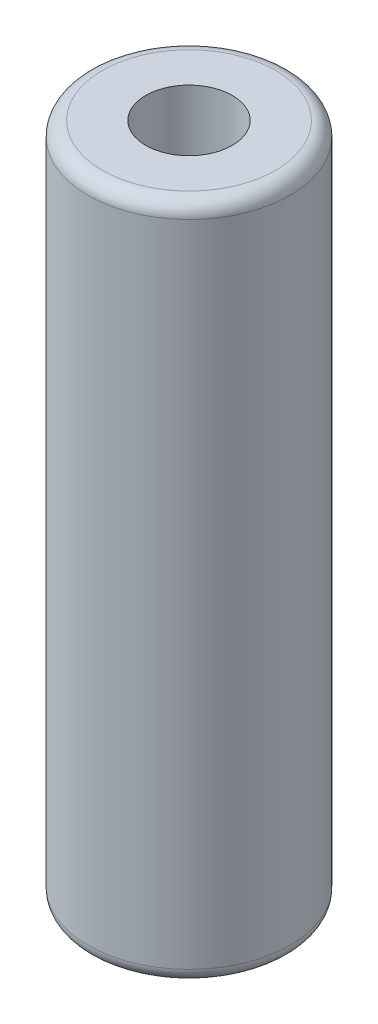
ISO-10303-21;
HEADER;
FILE_DESCRIPTION(('STEP AP214'),'2;1');
FILE_NAME('part.step','',(''),(''),'','','');
FILE_SCHEMA(('AUTOMOTIVE_DESIGN { 1 0 10303 214 1 1 1 1 }'));
ENDSEC;
DATA;
#1=APPLICATION_CONTEXT('core data for automotive mechanical design processes');
#2=APPLICATION_PROTOCOL_DEFINITION('international standard','automotive_design',2000,#1);
#3=PRODUCT_CONTEXT('',#1,'mechanical');
#4=PRODUCT('Part','Part','',(#3));
#5=PRODUCT_RELATED_PRODUCT_CATEGORY('part','',(#4));
#6=PRODUCT_DEFINITION_FORMATION('','',#4);
#7=PRODUCT_DEFINITION_CONTEXT('part definition',#1,'design');
#8=PRODUCT_DEFINITION('design','',#6,#7);
#9=PRODUCT_DEFINITION_SHAPE('','',#8);
#10=(LENGTH_UNIT() NAMED_UNIT(*) SI_UNIT(.MILLI.,.METRE.));
#11=(NAMED_UNIT(*) PLANE_ANGLE_UNIT() SI_UNIT($,.RADIAN.));
#12=(NAMED_UNIT(*) SI_UNIT($,.STERADIAN.) SOLID_ANGLE_UNIT());
#13=UNCERTAINTY_MEASURE_WITH_UNIT(LENGTH_MEASURE(1.E-05),#10,'distance_accuracy_value','');
#14=(GEOMETRIC_REPRESENTATION_CONTEXT(3) GLOBAL_UNCERTAINTY_ASSIGNED_CONTEXT((#13)) GLOBAL_UNIT_ASSIGNED_CONTEXT((#10,
#11,#12)) REPRESENTATION_CONTEXT('',''));
#15=CARTESIAN_POINT('',(0.,0.,0.));
#16=DIRECTION('',(0.,0.,1.));
#17=DIRECTION('',(1.,0.,0.));
#18=AXIS2_PLACEMENT_3D('',#15,#16,#17);
#19=CARTESIAN_POINT('',(0.,47.,0.));
#20=DIRECTION('',(0.,-1.,0.));
#21=DIRECTION('',(0.,0.,-1.));
#22=AXIS2_PLACEMENT_3D('',#19,#20,#21);
#23=CYLINDRICAL_SURFACE('',#22,7.);
#24=CARTESIAN_POINT('',(0.,1.,0.));
#25=DIRECTION('',(0.,1.,0.));
#26=DIRECTION('',(0.,0.,1.));
#27=AXIS2_PLACEMENT_3D('',#24,#25,#26);
#28=CIRCLE('',#27,7.);
#29=CARTESIAN_POINT('',(0.,1.,7.));
#30=VERTEX_POINT('',#29);
#31=EDGE_CURVE('E42',#30,#30,#28,.T.);
#32=ORIENTED_EDGE('',*,*,#31,.T.);
#33=EDGE_LOOP('',(#32));
#34=FACE_BOUND('',#33,.T.);
#35=CARTESIAN_POINT('',(0.,46.,0.));
#36=DIRECTION('',(0.,1.,0.));
#37=DIRECTION('',(0.,0.,1.));
#38=AXIS2_PLACEMENT_3D('',#35,#36,#37);
#39=CIRCLE('',#38,7.);
#40=CARTESIAN_POINT('',(0.,46.,7.));
#41=VERTEX_POINT('',#40);
#42=EDGE_CURVE('E46',#41,#41,#39,.F.);
#43=ORIENTED_EDGE('',*,*,#42,.T.);
#44=EDGE_LOOP('',(#43));
#45=FACE_BOUND('',#44,.T.);
#46=ADVANCED_FACE('F35',(#34,#45),#23,.T.);
#47=CARTESIAN_POINT('',(0.,47.,0.));
#48=DIRECTION('',(0.,1.,0.));
#49=DIRECTION('',(0.,0.,1.));
#50=AXIS2_PLACEMENT_3D('',#47,#48,#49);
#51=PLANE('',#50);
#52=CARTESIAN_POINT('',(0.,47.,0.));
#53=DIRECTION('',(0.,1.,0.));
#54=DIRECTION('',(0.,0.,1.));
#55=AXIS2_PLACEMENT_3D('',#52,#53,#54);
#56=CIRCLE('',#55,6.);
#57=CARTESIAN_POINT('',(0.,47.,6.));
#58=VERTEX_POINT('',#57);
#59=EDGE_CURVE('E10',#58,#58,#56,.T.);
#60=ORIENTED_EDGE('',*,*,#59,.T.);
#61=EDGE_LOOP('',(#60));
#62=FACE_BOUND('',#61,.T.);
#63=CARTESIAN_POINT('',(0.,47.,0.));
#64=DIRECTION('',(0.,-1.,0.));
#65=DIRECTION('',(0.,0.,-1.));
#66=AXIS2_PLACEMENT_3D('',#63,#64,#65);
#67=CIRCLE('',#66,3.);
#68=CARTESIAN_POINT('',(0.,47.,-3.));
#69=VERTEX_POINT('',#68);
#70=EDGE_CURVE('E58',#69,#69,#67,.T.);
#71=ORIENTED_EDGE('',*,*,#70,.T.);
#72=EDGE_LOOP('',(#71));
#73=FACE_BOUND('',#72,.T.);
#74=ADVANCED_FACE('F62',(#62,#73),#51,.T.);
#75=CARTESIAN_POINT('',(0.,47.,0.));
#76=DIRECTION('',(0.,-1.,0.));
#77=DIRECTION('',(0.,0.,-1.));
#78=AXIS2_PLACEMENT_3D('',#75,#76,#77);
#79=CYLINDRICAL_SURFACE('',#78,3.);
#80=CARTESIAN_POINT('',(0.,3.,0.));
#81=DIRECTION('',(0.,1.,0.));
#82=DIRECTION('',(0.,0.,1.));
#83=AXIS2_PLACEMENT_3D('',#80,#81,#82);
#84=CIRCLE('',#83,3.);
#85=CARTESIAN_POINT('',(0.,3.,3.));
#86=VERTEX_POINT('',#85);
#87=EDGE_CURVE('E55',#86,#86,#84,.F.);
#88=ORIENTED_EDGE('',*,*,#87,.T.);
#89=EDGE_LOOP('',(#88));
#90=FACE_BOUND('',#89,.T.);
#91=ORIENTED_EDGE('',*,*,#70,.F.);
#92=EDGE_LOOP('',(#91));
#93=FACE_BOUND('',#92,.T.);
#94=ADVANCED_FACE('F64',(#90,#93),#79,.F.);
#95=CARTESIAN_POINT('',(0.,3.,0.));
#96=DIRECTION('',(0.,-1.,0.));
#97=DIRECTION('',(0.,0.,-1.));
#98=AXIS2_PLACEMENT_3D('',#95,#96,#97);
#99=CONICAL_SURFACE('',#98,3.,0.78539816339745);
#100=CARTESIAN_POINT('',(0.,0.,0.));
#101=DIRECTION('',(0.,1.,0.));
#102=DIRECTION('',(0.,0.,1.));
#103=AXIS2_PLACEMENT_3D('',#100,#101,#102);
#104=CIRCLE('',#103,6.00000000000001);
#105=CARTESIAN_POINT('',(0.,0.,6.00000000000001));
#106=VERTEX_POINT('',#105);
#107=EDGE_CURVE('E50',#106,#106,#104,.T.);
#108=ORIENTED_EDGE('',*,*,#107,.F.);
#109=EDGE_LOOP('',(#108));
#110=FACE_BOUND('',#109,.T.);
#111=ORIENTED_EDGE('',*,*,#87,.F.);
#112=EDGE_LOOP('',(#111));
#113=FACE_BOUND('',#112,.T.);
#114=ADVANCED_FACE('F66',(#110,#113),#99,.F.);
#115=CARTESIAN_POINT('',(0.,1.,0.));
#116=DIRECTION('',(0.,1.,0.));
#117=DIRECTION('',(0.,0.,1.));
#118=AXIS2_PLACEMENT_3D('',#115,#116,#117);
#119=TOROIDAL_SURFACE('',#118,6.,1.);
#120=ORIENTED_EDGE('',*,*,#107,.T.);
#121=EDGE_LOOP('',(#120));
#122=FACE_BOUND('',#121,.T.);
#123=ORIENTED_EDGE('',*,*,#31,.F.);
#124=EDGE_LOOP('',(#123));
#125=FACE_BOUND('',#124,.T.);
#126=ADVANCED_FACE('F73',(#122,#125),#119,.T.);
#127=CARTESIAN_POINT('',(0.,46.,0.));
#128=DIRECTION('',(0.,1.,0.));
#129=DIRECTION('',(0.,0.,1.));
#130=AXIS2_PLACEMENT_3D('',#127,#128,#129);
#131=TOROIDAL_SURFACE('',#130,6.,1.);
#132=ORIENTED_EDGE('',*,*,#42,.F.);
#133=EDGE_LOOP('',(#132));
#134=FACE_BOUND('',#133,.T.);
#135=ORIENTED_EDGE('',*,*,#59,.F.);
#136=EDGE_LOOP('',(#135));
#137=FACE_BOUND('',#136,.T.);
#138=ADVANCED_FACE('F37',(#134,#137),#131,.T.);
#139=CLOSED_SHELL('',(#46,#74,#94,#114,#126,#138));
#140=MANIFOLD_SOLID_BREP('B2',#139);
#141=ADVANCED_BREP_SHAPE_REPRESENTATION('',(#18,#140),#14);
#142=SHAPE_DEFINITION_REPRESENTATION(#9,#141);
ENDSEC;
END-ISO-10303-21;
